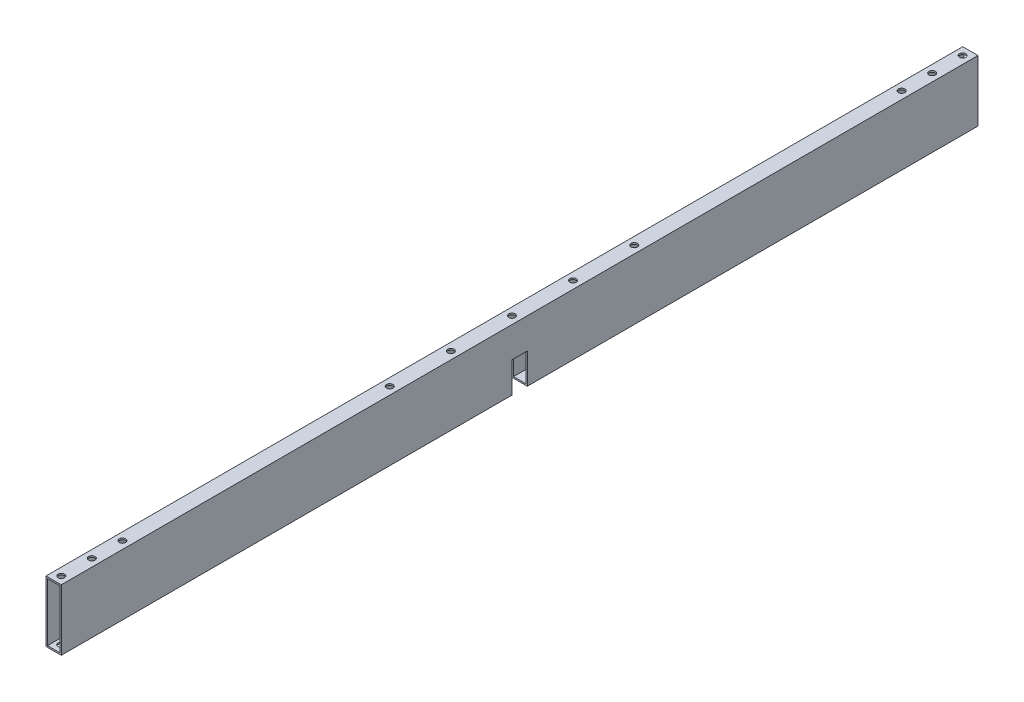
from build123d import *

# Parameters (mm, degrees)
SKETCH_1_W          = 10
SKETCH_1_H          = 40
SKETCH_1_W_2        = 8
SKETCH_1_H_2        = 38
EXTRUDE_1_DEPTH     = 300
SKETCH_2_R          = 2.1
CUT_EXTRUDE_1_DEPTH = 303.696217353
SKETCH_3_W          = 10
SKETCH_3_H          = 20
CUT_EXTRUDE_2_DEPTH = 301.83217913
SKETCH_4_R          = 2.1
CUT_EXTRUDE_3_DEPTH = 303.696217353


with BuildPart() as part:
    # Sketch 1 → Extrude 1 (new, symmetric)
    with BuildSketch(Plane.XY):
        Rectangle(SKETCH_1_W, SKETCH_1_H)
        Rectangle(SKETCH_1_W_2, SKETCH_1_H_2, mode=Mode.SUBTRACT)
    extrude(amount=EXTRUDE_1_DEPTH, both=True)

    # Sketch 2 → Cut-Extrude 1 (cut, through all)
    with BuildSketch(Plane(origin=(0, 20, 0), x_dir=(1, 0, 0), z_dir=(0, 1, 0))):
        with Locations(Location((0, 295, 0), (0, 0, 270))):
            Circle(SKETCH_2_R)
        with Locations(Location((0, 275, 0), (0, 0, 270))):
            Circle(SKETCH_2_R)
        with Locations(Location((0, 255, 0), (0, 0, 270))):
            Circle(SKETCH_2_R)
    cut_extrude_1 = extrude(amount=-CUT_EXTRUDE_1_DEPTH, mode=Mode.SUBTRACT)

    # Sketch 3 → Cut-Extrude 2 (cut, through all)
    with BuildSketch(Plane(origin=(5, 0, 0), x_dir=(0, 0, -1), z_dir=(1, 0, 0))):
        with Locations((0, -10)):
            Rectangle(SKETCH_3_W, SKETCH_3_H)
    extrude(amount=-CUT_EXTRUDE_2_DEPTH, mode=Mode.SUBTRACT)

    # Mirror 1: Cut-Extrude 1 across plane
    add(cut_extrude_1.mirror(Plane.XY), mode=Mode.SUBTRACT)

    # Sketch 4 → Cut-Extrude 3 (cut, through all)
    with BuildSketch(Plane(origin=(0, 20, 0), x_dir=(1, 0, 0), z_dir=(0, 1, 0))):
        with Locations(Location((0, -80, 0), (0, 0, 270))):
            Circle(SKETCH_4_R)
        with Locations(Location((0, -40, 0), (0, 0, 270))):
            Circle(SKETCH_4_R)
        with Locations(Location((0, 0, 0), (0, 0, 270))):
            Circle(SKETCH_4_R)
        with Locations(Location((0, 40, 0), (0, 0, 270))):
            Circle(SKETCH_4_R)
        with Locations(Location((0, 80, 0), (0, 0, 270))):
            Circle(SKETCH_4_R)
    extrude(amount=-CUT_EXTRUDE_3_DEPTH, mode=Mode.SUBTRACT)


solid = part.part
